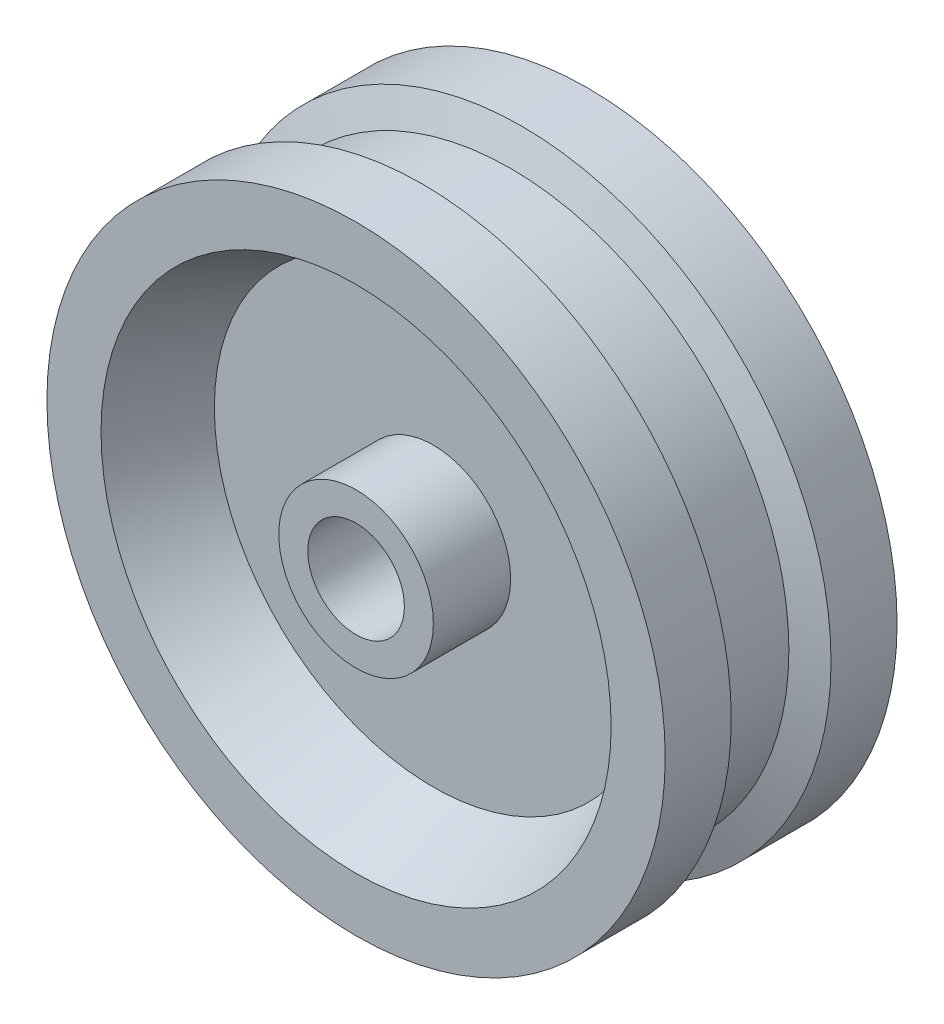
ISO-10303-21;
HEADER;
FILE_DESCRIPTION(('STEP AP214'),'2;1');
FILE_NAME('part.step','',(''),(''),'','','');
FILE_SCHEMA(('AUTOMOTIVE_DESIGN { 1 0 10303 214 1 1 1 1 }'));
ENDSEC;
DATA;
#1=APPLICATION_CONTEXT('core data for automotive mechanical design processes');
#2=APPLICATION_PROTOCOL_DEFINITION('international standard','automotive_design',2000,#1);
#3=PRODUCT_CONTEXT('',#1,'mechanical');
#4=PRODUCT('Part','Part','',(#3));
#5=PRODUCT_RELATED_PRODUCT_CATEGORY('part','',(#4));
#6=PRODUCT_DEFINITION_FORMATION('','',#4);
#7=PRODUCT_DEFINITION_CONTEXT('part definition',#1,'design');
#8=PRODUCT_DEFINITION('design','',#6,#7);
#9=PRODUCT_DEFINITION_SHAPE('','',#8);
#10=(LENGTH_UNIT() NAMED_UNIT(*) SI_UNIT(.MILLI.,.METRE.));
#11=(NAMED_UNIT(*) PLANE_ANGLE_UNIT() SI_UNIT($,.RADIAN.));
#12=(NAMED_UNIT(*) SI_UNIT($,.STERADIAN.) SOLID_ANGLE_UNIT());
#13=UNCERTAINTY_MEASURE_WITH_UNIT(LENGTH_MEASURE(1.E-05),#10,'distance_accuracy_value','');
#14=(GEOMETRIC_REPRESENTATION_CONTEXT(3) GLOBAL_UNCERTAINTY_ASSIGNED_CONTEXT((#13)) GLOBAL_UNIT_ASSIGNED_CONTEXT((#10,
#11,#12)) REPRESENTATION_CONTEXT('',''));
#15=CARTESIAN_POINT('',(0.,0.,0.));
#16=DIRECTION('',(0.,0.,1.));
#17=DIRECTION('',(1.,0.,0.));
#18=AXIS2_PLACEMENT_3D('',#15,#16,#17);
#19=CARTESIAN_POINT('',(0.,5.,7.5));
#20=DIRECTION('',(0.,0.,-1.));
#21=DIRECTION('',(-1.,0.,0.));
#22=AXIS2_PLACEMENT_3D('',#19,#20,#21);
#23=PLANE('',#22);
#24=CARTESIAN_POINT('',(0.,0.,7.5));
#25=DIRECTION('',(0.,0.,1.));
#26=DIRECTION('',(1.,0.,0.));
#27=AXIS2_PLACEMENT_3D('',#24,#25,#26);
#28=CIRCLE('',#27,3.125);
#29=CARTESIAN_POINT('',(3.125,0.,7.5));
#30=VERTEX_POINT('',#29);
#31=EDGE_CURVE('E10',#30,#30,#28,.T.);
#32=ORIENTED_EDGE('',*,*,#31,.F.);
#33=EDGE_LOOP('',(#32));
#34=FACE_BOUND('',#33,.T.);
#35=CARTESIAN_POINT('',(0.,0.,7.5));
#36=DIRECTION('',(0.,0.,1.));
#37=DIRECTION('',(1.,0.,0.));
#38=AXIS2_PLACEMENT_3D('',#35,#36,#37);
#39=CIRCLE('',#38,5.);
#40=CARTESIAN_POINT('',(5.,0.,7.5));
#41=VERTEX_POINT('',#40);
#42=EDGE_CURVE('E88',#41,#41,#39,.T.);
#43=ORIENTED_EDGE('',*,*,#42,.T.);
#44=EDGE_LOOP('',(#43));
#45=FACE_BOUND('',#44,.T.);
#46=ADVANCED_FACE('F36',(#34,#45),#23,.F.);
#47=CARTESIAN_POINT('',(0.,0.,11.9698208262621));
#48=DIRECTION('',(0.,0.,1.));
#49=DIRECTION('',(1.,0.,0.));
#50=AXIS2_PLACEMENT_3D('',#47,#48,#49);
#51=CYLINDRICAL_SURFACE('',#50,3.125);
#52=CARTESIAN_POINT('',(0.,0.,-7.5));
#53=DIRECTION('',(0.,0.,1.));
#54=DIRECTION('',(1.,0.,0.));
#55=AXIS2_PLACEMENT_3D('',#52,#53,#54);
#56=CIRCLE('',#55,3.125);
#57=CARTESIAN_POINT('',(3.125,0.,-7.5));
#58=VERTEX_POINT('',#57);
#59=EDGE_CURVE('E42',#58,#58,#56,.T.);
#60=ORIENTED_EDGE('',*,*,#59,.F.);
#61=EDGE_LOOP('',(#60));
#62=FACE_BOUND('',#61,.T.);
#63=ORIENTED_EDGE('',*,*,#31,.T.);
#64=EDGE_LOOP('',(#63));
#65=FACE_BOUND('',#64,.T.);
#66=ADVANCED_FACE('F173',(#62,#65),#51,.F.);
#67=CARTESIAN_POINT('',(0.,5.,-7.5));
#68=DIRECTION('',(0.,0.,1.));
#69=DIRECTION('',(1.,0.,0.));
#70=AXIS2_PLACEMENT_3D('',#67,#68,#69);
#71=PLANE('',#70);
#72=CARTESIAN_POINT('',(0.,0.,-7.5));
#73=DIRECTION('',(0.,0.,1.));
#74=DIRECTION('',(1.,0.,0.));
#75=AXIS2_PLACEMENT_3D('',#72,#73,#74);
#76=CIRCLE('',#75,5.);
#77=CARTESIAN_POINT('',(5.,0.,-7.5));
#78=VERTEX_POINT('',#77);
#79=EDGE_CURVE('E46',#78,#78,#76,.T.);
#80=ORIENTED_EDGE('',*,*,#79,.F.);
#81=EDGE_LOOP('',(#80));
#82=FACE_BOUND('',#81,.T.);
#83=ORIENTED_EDGE('',*,*,#59,.T.);
#84=EDGE_LOOP('',(#83));
#85=FACE_BOUND('',#84,.T.);
#86=ADVANCED_FACE('F168',(#82,#85),#71,.F.);
#87=CARTESIAN_POINT('',(0.,0.,11.9698208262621));
#88=DIRECTION('',(0.,0.,1.));
#89=DIRECTION('',(1.,0.,0.));
#90=AXIS2_PLACEMENT_3D('',#87,#88,#89);
#91=CYLINDRICAL_SURFACE('',#90,5.);
#92=CARTESIAN_POINT('',(0.,0.,-2.5));
#93=DIRECTION('',(0.,0.,1.));
#94=DIRECTION('',(1.,0.,0.));
#95=AXIS2_PLACEMENT_3D('',#92,#93,#94);
#96=CIRCLE('',#95,5.);
#97=CARTESIAN_POINT('',(5.,0.,-2.5));
#98=VERTEX_POINT('',#97);
#99=EDGE_CURVE('E50',#98,#98,#96,.T.);
#100=ORIENTED_EDGE('',*,*,#99,.F.);
#101=EDGE_LOOP('',(#100));
#102=FACE_BOUND('',#101,.T.);
#103=ORIENTED_EDGE('',*,*,#79,.T.);
#104=EDGE_LOOP('',(#103));
#105=FACE_BOUND('',#104,.T.);
#106=ADVANCED_FACE('F162',(#102,#105),#91,.T.);
#107=CARTESIAN_POINT('',(0.,5.,-2.5));
#108=DIRECTION('',(0.,0.,1.));
#109=DIRECTION('',(1.,0.,0.));
#110=AXIS2_PLACEMENT_3D('',#107,#108,#109);
#111=PLANE('',#110);
#112=CARTESIAN_POINT('',(0.,0.,-2.5));
#113=DIRECTION('',(0.,0.,1.));
#114=DIRECTION('',(1.,0.,0.));
#115=AXIS2_PLACEMENT_3D('',#112,#113,#114);
#116=CIRCLE('',#115,14.168461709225);
#117=CARTESIAN_POINT('',(14.168461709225,0.,-2.5));
#118=VERTEX_POINT('',#117);
#119=EDGE_CURVE('E55',#118,#118,#116,.T.);
#120=ORIENTED_EDGE('',*,*,#119,.F.);
#121=EDGE_LOOP('',(#120));
#122=FACE_BOUND('',#121,.T.);
#123=ORIENTED_EDGE('',*,*,#99,.T.);
#124=EDGE_LOOP('',(#123));
#125=FACE_BOUND('',#124,.T.);
#126=ADVANCED_FACE('F156',(#122,#125),#111,.F.);
#127=CARTESIAN_POINT('',(0.,0.,-2.5));
#128=DIRECTION('',(0.,0.,-1.));
#129=DIRECTION('',(-1.,0.,0.));
#130=AXIS2_PLACEMENT_3D('',#127,#128,#129);
#131=CONICAL_SURFACE('',#130,14.168461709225,0.436332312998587);
#132=CARTESIAN_POINT('',(0.,0.,-7.5));
#133=DIRECTION('',(0.,0.,1.));
#134=DIRECTION('',(1.,0.,0.));
#135=AXIS2_PLACEMENT_3D('',#132,#133,#134);
#136=CIRCLE('',#135,16.5);
#137=CARTESIAN_POINT('',(16.5,0.,-7.5));
#138=VERTEX_POINT('',#137);
#139=EDGE_CURVE('E58',#138,#138,#136,.T.);
#140=ORIENTED_EDGE('',*,*,#139,.F.);
#141=EDGE_LOOP('',(#140));
#142=FACE_BOUND('',#141,.T.);
#143=ORIENTED_EDGE('',*,*,#119,.T.);
#144=EDGE_LOOP('',(#143));
#145=FACE_BOUND('',#144,.T.);
#146=ADVANCED_FACE('F150',(#142,#145),#131,.F.);
#147=CARTESIAN_POINT('',(0.,20.,-7.5));
#148=DIRECTION('',(0.,0.,1.));
#149=DIRECTION('',(1.,0.,0.));
#150=AXIS2_PLACEMENT_3D('',#147,#148,#149);
#151=PLANE('',#150);
#152=CARTESIAN_POINT('',(0.,0.,-7.5));
#153=DIRECTION('',(0.,0.,1.));
#154=DIRECTION('',(1.,0.,0.));
#155=AXIS2_PLACEMENT_3D('',#152,#153,#154);
#156=CIRCLE('',#155,20.);
#157=CARTESIAN_POINT('',(20.,0.,-7.5));
#158=VERTEX_POINT('',#157);
#159=EDGE_CURVE('E61',#158,#158,#156,.T.);
#160=ORIENTED_EDGE('',*,*,#159,.F.);
#161=EDGE_LOOP('',(#160));
#162=FACE_BOUND('',#161,.T.);
#163=ORIENTED_EDGE('',*,*,#139,.T.);
#164=EDGE_LOOP('',(#163));
#165=FACE_BOUND('',#164,.T.);
#166=ADVANCED_FACE('F144',(#162,#165),#151,.F.);
#167=CARTESIAN_POINT('',(0.,0.,11.9698208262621));
#168=DIRECTION('',(0.,0.,1.));
#169=DIRECTION('',(1.,0.,0.));
#170=AXIS2_PLACEMENT_3D('',#167,#168,#169);
#171=CYLINDRICAL_SURFACE('',#170,20.);
#172=CARTESIAN_POINT('',(0.,0.,-3.22794046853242));
#173=DIRECTION('',(0.,0.,1.));
#174=DIRECTION('',(1.,0.,0.));
#175=AXIS2_PLACEMENT_3D('',#172,#173,#174);
#176=CIRCLE('',#175,20.);
#177=CARTESIAN_POINT('',(20.,0.,-3.22794046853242));
#178=VERTEX_POINT('',#177);
#179=EDGE_CURVE('E64',#178,#178,#176,.T.);
#180=ORIENTED_EDGE('',*,*,#179,.F.);
#181=EDGE_LOOP('',(#180));
#182=FACE_BOUND('',#181,.T.);
#183=ORIENTED_EDGE('',*,*,#159,.T.);
#184=EDGE_LOOP('',(#183));
#185=FACE_BOUND('',#184,.T.);
#186=ADVANCED_FACE('F138',(#182,#185),#171,.T.);
#187=CARTESIAN_POINT('',(0.,0.,-3.22794046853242));
#188=DIRECTION('',(0.,0.,-1.));
#189=DIRECTION('',(-1.,0.,0.));
#190=AXIS2_PLACEMENT_3D('',#187,#188,#189);
#191=CONICAL_SURFACE('',#190,20.,1.22173047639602);
#192=CARTESIAN_POINT('',(0.,0.,-2.5));
#193=DIRECTION('',(0.,0.,1.));
#194=DIRECTION('',(1.,0.,0.));
#195=AXIS2_PLACEMENT_3D('',#192,#193,#194);
#196=CIRCLE('',#195,18.);
#197=CARTESIAN_POINT('',(18.,0.,-2.5));
#198=VERTEX_POINT('',#197);
#199=EDGE_CURVE('E67',#198,#198,#196,.T.);
#200=ORIENTED_EDGE('',*,*,#199,.F.);
#201=EDGE_LOOP('',(#200));
#202=FACE_BOUND('',#201,.T.);
#203=ORIENTED_EDGE('',*,*,#179,.T.);
#204=EDGE_LOOP('',(#203));
#205=FACE_BOUND('',#204,.T.);
#206=ADVANCED_FACE('F132',(#202,#205),#191,.T.);
#207=CARTESIAN_POINT('',(0.,0.,11.9698208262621));
#208=DIRECTION('',(0.,0.,1.));
#209=DIRECTION('',(1.,0.,0.));
#210=AXIS2_PLACEMENT_3D('',#207,#208,#209);
#211=CYLINDRICAL_SURFACE('',#210,18.);
#212=CARTESIAN_POINT('',(0.,0.,2.5));
#213=DIRECTION('',(0.,0.,1.));
#214=DIRECTION('',(1.,0.,0.));
#215=AXIS2_PLACEMENT_3D('',#212,#213,#214);
#216=CIRCLE('',#215,18.);
#217=CARTESIAN_POINT('',(18.,0.,2.5));
#218=VERTEX_POINT('',#217);
#219=EDGE_CURVE('E70',#218,#218,#216,.T.);
#220=ORIENTED_EDGE('',*,*,#219,.F.);
#221=EDGE_LOOP('',(#220));
#222=FACE_BOUND('',#221,.T.);
#223=ORIENTED_EDGE('',*,*,#199,.T.);
#224=EDGE_LOOP('',(#223));
#225=FACE_BOUND('',#224,.T.);
#226=ADVANCED_FACE('F126',(#222,#225),#211,.T.);
#227=CARTESIAN_POINT('',(0.,0.,2.5));
#228=DIRECTION('',(0.,0.,1.));
#229=DIRECTION('',(1.,0.,0.));
#230=AXIS2_PLACEMENT_3D('',#227,#228,#229);
#231=CONICAL_SURFACE('',#230,18.,1.22173047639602);
#232=CARTESIAN_POINT('',(0.,0.,3.22794046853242));
#233=DIRECTION('',(0.,0.,1.));
#234=DIRECTION('',(1.,0.,0.));
#235=AXIS2_PLACEMENT_3D('',#232,#233,#234);
#236=CIRCLE('',#235,20.);
#237=CARTESIAN_POINT('',(20.,0.,3.22794046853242));
#238=VERTEX_POINT('',#237);
#239=EDGE_CURVE('E73',#238,#238,#236,.T.);
#240=ORIENTED_EDGE('',*,*,#239,.F.);
#241=EDGE_LOOP('',(#240));
#242=FACE_BOUND('',#241,.T.);
#243=ORIENTED_EDGE('',*,*,#219,.T.);
#244=EDGE_LOOP('',(#243));
#245=FACE_BOUND('',#244,.T.);
#246=ADVANCED_FACE('F120',(#242,#245),#231,.T.);
#247=CARTESIAN_POINT('',(0.,0.,11.9698208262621));
#248=DIRECTION('',(0.,0.,1.));
#249=DIRECTION('',(1.,0.,0.));
#250=AXIS2_PLACEMENT_3D('',#247,#248,#249);
#251=CYLINDRICAL_SURFACE('',#250,20.);
#252=CARTESIAN_POINT('',(0.,0.,7.5));
#253=DIRECTION('',(0.,0.,1.));
#254=DIRECTION('',(1.,0.,0.));
#255=AXIS2_PLACEMENT_3D('',#252,#253,#254);
#256=CIRCLE('',#255,20.);
#257=CARTESIAN_POINT('',(20.,0.,7.5));
#258=VERTEX_POINT('',#257);
#259=EDGE_CURVE('E76',#258,#258,#256,.T.);
#260=ORIENTED_EDGE('',*,*,#259,.F.);
#261=EDGE_LOOP('',(#260));
#262=FACE_BOUND('',#261,.T.);
#263=ORIENTED_EDGE('',*,*,#239,.T.);
#264=EDGE_LOOP('',(#263));
#265=FACE_BOUND('',#264,.T.);
#266=ADVANCED_FACE('F114',(#262,#265),#251,.T.);
#267=CARTESIAN_POINT('',(0.,20.,7.5));
#268=DIRECTION('',(0.,0.,-1.));
#269=DIRECTION('',(-1.,0.,0.));
#270=AXIS2_PLACEMENT_3D('',#267,#268,#269);
#271=PLANE('',#270);
#272=CARTESIAN_POINT('',(0.,0.,7.5));
#273=DIRECTION('',(0.,0.,1.));
#274=DIRECTION('',(1.,0.,0.));
#275=AXIS2_PLACEMENT_3D('',#272,#273,#274);
#276=CIRCLE('',#275,16.5);
#277=CARTESIAN_POINT('',(16.5,0.,7.5));
#278=VERTEX_POINT('',#277);
#279=EDGE_CURVE('E79',#278,#278,#276,.T.);
#280=ORIENTED_EDGE('',*,*,#279,.F.);
#281=EDGE_LOOP('',(#280));
#282=FACE_BOUND('',#281,.T.);
#283=ORIENTED_EDGE('',*,*,#259,.T.);
#284=EDGE_LOOP('',(#283));
#285=FACE_BOUND('',#284,.T.);
#286=ADVANCED_FACE('F108',(#282,#285),#271,.F.);
#287=CARTESIAN_POINT('',(0.,0.,7.5));
#288=DIRECTION('',(0.,0.,1.));
#289=DIRECTION('',(1.,0.,0.));
#290=AXIS2_PLACEMENT_3D('',#287,#288,#289);
#291=CONICAL_SURFACE('',#290,16.5,0.436332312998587);
#292=CARTESIAN_POINT('',(0.,0.,2.5));
#293=DIRECTION('',(0.,0.,1.));
#294=DIRECTION('',(1.,0.,0.));
#295=AXIS2_PLACEMENT_3D('',#292,#293,#294);
#296=CIRCLE('',#295,14.168461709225);
#297=CARTESIAN_POINT('',(14.168461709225,0.,2.5));
#298=VERTEX_POINT('',#297);
#299=EDGE_CURVE('E82',#298,#298,#296,.T.);
#300=ORIENTED_EDGE('',*,*,#299,.F.);
#301=EDGE_LOOP('',(#300));
#302=FACE_BOUND('',#301,.T.);
#303=ORIENTED_EDGE('',*,*,#279,.T.);
#304=EDGE_LOOP('',(#303));
#305=FACE_BOUND('',#304,.T.);
#306=ADVANCED_FACE('F102',(#302,#305),#291,.F.);
#307=CARTESIAN_POINT('',(0.,5.,2.5));
#308=DIRECTION('',(0.,0.,-1.));
#309=DIRECTION('',(-1.,0.,0.));
#310=AXIS2_PLACEMENT_3D('',#307,#308,#309);
#311=PLANE('',#310);
#312=CARTESIAN_POINT('',(0.,0.,2.5));
#313=DIRECTION('',(0.,0.,1.));
#314=DIRECTION('',(1.,0.,0.));
#315=AXIS2_PLACEMENT_3D('',#312,#313,#314);
#316=CIRCLE('',#315,5.);
#317=CARTESIAN_POINT('',(5.,0.,2.5));
#318=VERTEX_POINT('',#317);
#319=EDGE_CURVE('E85',#318,#318,#316,.T.);
#320=ORIENTED_EDGE('',*,*,#319,.F.);
#321=EDGE_LOOP('',(#320));
#322=FACE_BOUND('',#321,.T.);
#323=ORIENTED_EDGE('',*,*,#299,.T.);
#324=EDGE_LOOP('',(#323));
#325=FACE_BOUND('',#324,.T.);
#326=ADVANCED_FACE('F96',(#322,#325),#311,.F.);
#327=CARTESIAN_POINT('',(0.,0.,11.9698208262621));
#328=DIRECTION('',(0.,0.,1.));
#329=DIRECTION('',(1.,0.,0.));
#330=AXIS2_PLACEMENT_3D('',#327,#328,#329);
#331=CYLINDRICAL_SURFACE('',#330,5.);
#332=ORIENTED_EDGE('',*,*,#42,.F.);
#333=EDGE_LOOP('',(#332));
#334=FACE_BOUND('',#333,.T.);
#335=ORIENTED_EDGE('',*,*,#319,.T.);
#336=EDGE_LOOP('',(#335));
#337=FACE_BOUND('',#336,.T.);
#338=ADVANCED_FACE('F93',(#334,#337),#331,.T.);
#339=CLOSED_SHELL('',(#46,#66,#86,#106,#126,#146,#166,#186,#206,#226,#246,#266,#286,#306,#326,#338));
#340=MANIFOLD_SOLID_BREP('B2',#339);
#341=ADVANCED_BREP_SHAPE_REPRESENTATION('',(#18,#340),#14);
#342=SHAPE_DEFINITION_REPRESENTATION(#9,#341);
ENDSEC;
END-ISO-10303-21;
